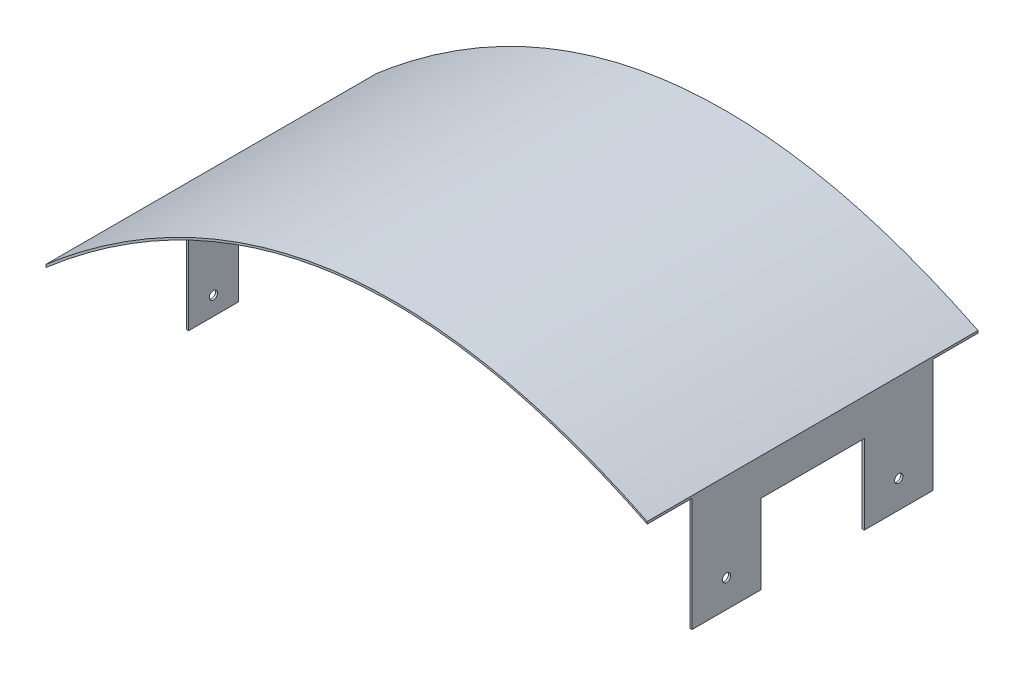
ISO-10303-21;
HEADER;
FILE_DESCRIPTION(('STEP AP214'),'2;1');
FILE_NAME('part.step','',(''),(''),'','','');
FILE_SCHEMA(('AUTOMOTIVE_DESIGN { 1 0 10303 214 1 1 1 1 }'));
ENDSEC;
DATA;
#1=APPLICATION_CONTEXT('core data for automotive mechanical design processes');
#2=APPLICATION_PROTOCOL_DEFINITION('international standard','automotive_design',2000,#1);
#3=PRODUCT_CONTEXT('',#1,'mechanical');
#4=PRODUCT('Part','Part','',(#3));
#5=PRODUCT_RELATED_PRODUCT_CATEGORY('part','',(#4));
#6=PRODUCT_DEFINITION_FORMATION('','',#4);
#7=PRODUCT_DEFINITION_CONTEXT('part definition',#1,'design');
#8=PRODUCT_DEFINITION('design','',#6,#7);
#9=PRODUCT_DEFINITION_SHAPE('','',#8);
#10=(LENGTH_UNIT() NAMED_UNIT(*) SI_UNIT(.MILLI.,.METRE.));
#11=(NAMED_UNIT(*) PLANE_ANGLE_UNIT() SI_UNIT($,.RADIAN.));
#12=(NAMED_UNIT(*) SI_UNIT($,.STERADIAN.) SOLID_ANGLE_UNIT());
#13=UNCERTAINTY_MEASURE_WITH_UNIT(LENGTH_MEASURE(1.E-05),#10,'distance_accuracy_value','');
#14=(GEOMETRIC_REPRESENTATION_CONTEXT(3) GLOBAL_UNCERTAINTY_ASSIGNED_CONTEXT((#13)) GLOBAL_UNIT_ASSIGNED_CONTEXT((#10,
#11,#12)) REPRESENTATION_CONTEXT('',''));
#15=CARTESIAN_POINT('',(0.,0.,0.));
#16=DIRECTION('',(0.,0.,1.));
#17=DIRECTION('',(1.,0.,0.));
#18=AXIS2_PLACEMENT_3D('',#15,#16,#17);
#19=CARTESIAN_POINT('',(-45.2500009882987,46.2333333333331,-114.233194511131));
#20=CARTESIAN_POINT('',(-5.08384592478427,80.8869347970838,-114.233194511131));
#21=CARTESIAN_POINT('',(41.9999999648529,57.599997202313,-114.233194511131));
#22=B_SPLINE_CURVE_WITH_KNOTS('',2,(#19,#20,#21),.UNSPECIFIED.,.F.,.F.,(3,3),(0.,1.),.UNSPECIFIED.);
#23=DIRECTION('',(0.,0.,1.));
#24=VECTOR('',#23,1.);
#25=SURFACE_OF_LINEAR_EXTRUSION('',#22,#24);
#26=CARTESIAN_POINT('',(41.6999999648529,57.747818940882,-17.5000084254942));
#27=CARTESIAN_POINT('',(41.7500365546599,57.723256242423,-17.5000084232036));
#28=CARTESIAN_POINT('',(41.8000548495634,57.6986564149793,-17.5000084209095));
#29=CARTESIAN_POINT('',(41.9000548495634,57.649382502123,-17.5000084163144));
#30=CARTESIAN_POINT('',(41.9500365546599,57.6247084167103,-17.5000084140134));
#31=CARTESIAN_POINT('',(41.9999999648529,57.599997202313,-17.5000084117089));
#32=B_SPLINE_CURVE_WITH_KNOTS('',3,(#26,#27,#28,#29,#30,#31),.UNSPECIFIED.,.F.,.F.,(4,2,4),(0.,
0.167220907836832,0.334441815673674),.UNSPECIFIED.);
#33=CARTESIAN_POINT('',(41.6999999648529,57.747818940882,-17.5000089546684));
#34=VERTEX_POINT('',#33);
#35=CARTESIAN_POINT('',(41.9999999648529,57.599997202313,-17.5000084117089));
#36=VERTEX_POINT('',#35);
#37=EDGE_CURVE('E888',#34,#36,#32,.T.);
#38=ORIENTED_EDGE('',*,*,#37,.F.);
#39=DIRECTION('',(0.,0.,1.));
#40=VECTOR('',#39,1.);
#41=CARTESIAN_POINT('',(41.6999999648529,57.747818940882,-4.31154512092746E-06));
#42=LINE('',#41,#40);
#43=CARTESIAN_POINT('',(41.6999999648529,57.747818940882,17.49999765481));
#44=VERTEX_POINT('',#43);
#45=EDGE_CURVE('E892',#44,#34,#42,.F.);
#46=ORIENTED_EDGE('',*,*,#45,.F.);
#47=CARTESIAN_POINT('',(41.9999999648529,57.5999988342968,17.499997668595));
#48=CARTESIAN_POINT('',(41.9500363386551,57.6247093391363,17.4999976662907));
#49=CARTESIAN_POINT('',(41.9000545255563,57.6493829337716,17.4999976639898));
#50=CARTESIAN_POINT('',(41.8000545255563,57.6986563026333,17.4999976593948));
#51=CARTESIAN_POINT('',(41.7500363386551,57.7232560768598,17.4999976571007));
#52=CARTESIAN_POINT('',(41.6999999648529,57.747818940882,17.49999765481));
#53=B_SPLINE_CURVE_WITH_KNOTS('',3,(#47,#48,#49,#50,#51,#52),.UNSPECIFIED.,.F.,.F.,(4,2,4),(0.,
0.167220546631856,0.334441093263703),.UNSPECIFIED.);
#54=CARTESIAN_POINT('',(41.9999999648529,57.6000004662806,17.499997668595));
#55=VERTEX_POINT('',#54);
#56=EDGE_CURVE('E1101',#55,#44,#53,.T.);
#57=ORIENTED_EDGE('',*,*,#56,.F.);
#58=DIRECTION('',(0.,0.,1.));
#59=VECTOR('',#58,1.);
#60=CARTESIAN_POINT('',(41.9999999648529,57.599997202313,-114.233194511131));
#61=LINE('',#60,#59);
#62=CARTESIAN_POINT('',(41.9999999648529,57.599997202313,23.9999942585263));
#63=VERTEX_POINT('',#62);
#64=EDGE_CURVE('E1218',#55,#63,#61,.T.);
#65=ORIENTED_EDGE('',*,*,#64,.T.);
#66=CARTESIAN_POINT('',(-45.2500009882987,46.2333333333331,23.9999942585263));
#67=CARTESIAN_POINT('',(-5.08384592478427,80.8869347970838,23.9999942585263));
#68=CARTESIAN_POINT('',(41.9999999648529,57.599997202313,23.9999942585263));
#69=B_SPLINE_CURVE_WITH_KNOTS('',2,(#66,#67,#68),.UNSPECIFIED.,.F.,.F.,(3,3),(0.,1.),.UNSPECIFIED.);
#70=CARTESIAN_POINT('',(-45.2500009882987,46.2333333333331,23.9999942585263));
#71=VERTEX_POINT('',#70);
#72=EDGE_CURVE('E1193',#71,#63,#69,.T.);
#73=ORIENTED_EDGE('',*,*,#72,.F.);
#74=DIRECTION('',(0.,0.,1.));
#75=VECTOR('',#74,1.);
#76=CARTESIAN_POINT('',(-45.2500009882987,46.2333333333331,-114.233194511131));
#77=LINE('',#76,#75);
#78=CARTESIAN_POINT('',(-45.2500009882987,46.2333340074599,3.6143761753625));
#79=VERTEX_POINT('',#78);
#80=EDGE_CURVE('E1223',#79,#71,#77,.T.);
#81=ORIENTED_EDGE('',*,*,#80,.F.);
#82=CARTESIAN_POINT('',(-44.9500009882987,46.4912694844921,3.61437615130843));
#83=CARTESIAN_POINT('',(-45.0000743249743,46.4483654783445,3.61437615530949));
#84=CARTESIAN_POINT('',(-45.0501109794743,46.4054188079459,3.61437615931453));
#85=CARTESIAN_POINT('',(-45.1501109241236,46.3194401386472,3.61437616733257));
#86=CARTESIAN_POINT('',(-45.2000742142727,46.2764081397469,3.61437617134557));
#87=CARTESIAN_POINT('',(-45.2500008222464,46.2333334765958,3.61437617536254));
#88=B_SPLINE_CURVE_WITH_KNOTS('',3,(#82,#83,#84,#85,#86,#87),.UNSPECIFIED.,.F.,.F.,(4,2,4),(0.,
0.197819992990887,0.395639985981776),.UNSPECIFIED.);
#89=CARTESIAN_POINT('',(-44.9500009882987,46.4912694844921,3.61437510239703));
#90=VERTEX_POINT('',#89);
#91=EDGE_CURVE('E1145',#90,#79,#88,.T.);
#92=ORIENTED_EDGE('',*,*,#91,.F.);
#93=DIRECTION('',(0.,0.,1.));
#94=VECTOR('',#93,1.);
#95=CARTESIAN_POINT('',(-44.9500009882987,46.4912694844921,-4.31154512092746E-06));
#96=LINE('',#95,#94);
#97=CARTESIAN_POINT('',(-44.9500009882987,46.4912694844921,-3.61438587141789));
#98=VERTEX_POINT('',#97);
#99=EDGE_CURVE('E1141',#98,#90,#96,.T.);
#100=ORIENTED_EDGE('',*,*,#99,.F.);
#101=CARTESIAN_POINT('',(-45.2500009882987,46.2333333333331,-3.61438479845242));
#102=CARTESIAN_POINT('',(-45.2000743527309,46.2764080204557,-3.61438480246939));
#103=CARTESIAN_POINT('',(-45.150111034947,46.3194400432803,-3.61438480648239));
#104=CARTESIAN_POINT('',(-45.050111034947,46.4054187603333,-3.61438481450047));
#105=CARTESIAN_POINT('',(-45.0000743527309,46.4483654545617,-3.61438481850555));
#106=CARTESIAN_POINT('',(-44.9500009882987,46.4912694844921,-3.61438482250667));
#107=B_SPLINE_CURVE_WITH_KNOTS('',3,(#101,#102,#103,#104,#105,#106),.UNSPECIFIED.,.F.,.F.,(4,2,
4),(0.,0.197820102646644,0.395640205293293),.UNSPECIFIED.);
#108=CARTESIAN_POINT('',(-45.2500009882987,46.2333333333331,-3.61438479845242));
#109=VERTEX_POINT('',#108);
#110=EDGE_CURVE('E1153',#109,#98,#107,.T.);
#111=ORIENTED_EDGE('',*,*,#110,.F.);
#112=CARTESIAN_POINT('',(-45.2500009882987,46.2333333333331,-24.0000028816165));
#113=VERTEX_POINT('',#112);
#114=EDGE_CURVE('E1219',#113,#109,#77,.T.);
#115=ORIENTED_EDGE('',*,*,#114,.F.);
#116=CARTESIAN_POINT('',(-45.2500009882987,46.2333333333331,-24.0000028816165));
#117=CARTESIAN_POINT('',(-5.08384592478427,80.8869347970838,-24.0000028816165));
#118=CARTESIAN_POINT('',(41.9999999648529,57.599997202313,-24.0000028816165));
#119=B_SPLINE_CURVE_WITH_KNOTS('',2,(#116,#117,#118),.UNSPECIFIED.,.F.,.F.,(3,3),(0.,1.),.UNSPECIFIED.);
#120=CARTESIAN_POINT('',(41.9999999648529,57.599997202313,-24.0000028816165));
#121=VERTEX_POINT('',#120);
#122=EDGE_CURVE('E881',#121,#113,#119,.F.);
#123=ORIENTED_EDGE('',*,*,#122,.F.);
#124=EDGE_CURVE('E1227',#121,#36,#61,.T.);
#125=ORIENTED_EDGE('',*,*,#124,.T.);
#126=EDGE_LOOP('',(#38,#46,#57,#65,#73,#81,#92,#100,#111,#115,#123,#125));
#127=FACE_BOUND('',#126,.T.);
#128=ADVANCED_FACE('F873',(#127),#25,.T.);
#129=CARTESIAN_POINT('',(-45.2500009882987,46.6291754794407,-114.233194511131));
#130=DIRECTION('',(-1.,0.,0.));
#131=DIRECTION('',(0.,-1.,0.));
#132=AXIS2_PLACEMENT_3D('',#129,#130,#131);
#133=PLANE('',#132);
#134=DIRECTION('',(0.,1.,0.));
#135=VECTOR('',#134,1.);
#136=CARTESIAN_POINT('',(-45.2500009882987,46.6291754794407,-24.0000028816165));
#137=LINE('',#136,#135);
#138=CARTESIAN_POINT('',(-45.2500009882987,46.6291754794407,-24.0000028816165));
#139=VERTEX_POINT('',#138);
#140=EDGE_CURVE('E1262',#113,#139,#137,.T.);
#141=ORIENTED_EDGE('',*,*,#140,.F.);
#142=ORIENTED_EDGE('',*,*,#114,.T.);
#143=DIRECTION('',(0.,-1.,0.));
#144=VECTOR('',#143,1.);
#145=CARTESIAN_POINT('',(-45.2500009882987,33.7333333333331,-3.61438479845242));
#146=LINE('',#145,#144);
#147=CARTESIAN_POINT('',(-45.2500009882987,28.2333333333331,-3.61438479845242));
#148=VERTEX_POINT('',#147);
#149=EDGE_CURVE('E1275',#109,#148,#146,.T.);
#150=ORIENTED_EDGE('',*,*,#149,.T.);
#151=DIRECTION('',(0.,0.,1.));
#152=VECTOR('',#151,1.);
#153=CARTESIAN_POINT('',(-45.2500009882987,28.2333333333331,-3.61438479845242));
#154=LINE('',#153,#152);
#155=CARTESIAN_POINT('',(-45.2500009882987,28.2333333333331,-2.63293334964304E-06));
#156=VERTEX_POINT('',#155);
#157=EDGE_CURVE('E1294',#148,#156,#154,.T.);
#158=ORIENTED_EDGE('',*,*,#157,.T.);
#159=DIRECTION('',(0.,1.86512397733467E-07,0.999999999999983));
#160=VECTOR('',#159,1.);
#161=CARTESIAN_POINT('',(-45.2500009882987,28.2333340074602,3.61437953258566));
#162=LINE('',#161,#160);
#163=CARTESIAN_POINT('',(-45.2500009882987,28.2333340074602,3.61437953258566));
#164=VERTEX_POINT('',#163);
#165=EDGE_CURVE('E1285',#156,#164,#162,.T.);
#166=ORIENTED_EDGE('',*,*,#165,.T.);
#167=DIRECTION('',(0.,0.999999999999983,-1.86512397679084E-07));
#168=VECTOR('',#167,1.);
#169=CARTESIAN_POINT('',(-45.2500009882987,33.7333340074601,3.61437850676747));
#170=LINE('',#169,#168);
#171=EDGE_CURVE('E1244',#164,#79,#170,.T.);
#172=ORIENTED_EDGE('',*,*,#171,.T.);
#173=ORIENTED_EDGE('',*,*,#80,.T.);
#174=DIRECTION('',(0.,-1.,0.));
#175=VECTOR('',#174,1.);
#176=CARTESIAN_POINT('',(-45.2500009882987,46.6291754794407,23.9999942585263));
#177=LINE('',#176,#175);
#178=CARTESIAN_POINT('',(-45.2500009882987,46.6291754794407,23.9999942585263));
#179=VERTEX_POINT('',#178);
#180=EDGE_CURVE('E1212',#179,#71,#177,.T.);
#181=ORIENTED_EDGE('',*,*,#180,.F.);
#182=DIRECTION('',(0.,0.,1.));
#183=VECTOR('',#182,1.);
#184=CARTESIAN_POINT('',(-45.2500009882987,46.6291754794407,-114.233194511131));
#185=LINE('',#184,#183);
#186=EDGE_CURVE('E1224',#139,#179,#185,.T.);
#187=ORIENTED_EDGE('',*,*,#186,.F.);
#188=EDGE_LOOP('',(#141,#142,#150,#158,#166,#172,#173,#181,#187));
#189=FACE_BOUND('',#188,.T.);
#190=CARTESIAN_POINT('',(-45.2500009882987,30.8999999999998,-2.8816165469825E-06));
#191=DIRECTION('',(-1.,0.,0.));
#192=DIRECTION('',(0.,0.,1.));
#193=AXIS2_PLACEMENT_3D('',#190,#191,#192);
#194=CIRCLE('',#193,0.600000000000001);
#195=CARTESIAN_POINT('',(-45.2500009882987,30.8999999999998,0.599997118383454));
#196=VERTEX_POINT('',#195);
#197=EDGE_CURVE('E1108',#196,#196,#194,.T.);
#198=ORIENTED_EDGE('',*,*,#197,.F.);
#199=EDGE_LOOP('',(#198));
#200=FACE_BOUND('',#199,.T.);
#201=ADVANCED_FACE('F1177',(#189,#200),#133,.T.);
#202=CARTESIAN_POINT('',(42.1329879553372,57.8688856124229,-114.233194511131));
#203=CARTESIAN_POINT('',(24.4285494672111,66.6285236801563,-114.233194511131));
#204=CARTESIAN_POINT('',(-3.50191950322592,67.6088890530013,-114.233194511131));
#205=CARTESIAN_POINT('',(-30.3449209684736,59.4929238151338,-114.233194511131));
#206=CARTESIAN_POINT('',(-45.4459472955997,46.4604500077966,-114.233194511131));
#207=B_SPLINE_CURVE_WITH_KNOTS('',2,(#202,#203,#204,#205,#206),.UNSPECIFIED.,.F.,.F.,(3,1,1,3),
(0.,0.375,0.625,1.),.UNSPECIFIED.);
#208=DIRECTION('',(0.,0.,1.));
#209=VECTOR('',#208,1.);
#210=SURFACE_OF_LINEAR_EXTRUSION('',#207,#209);
#211=CARTESIAN_POINT('',(42.1329879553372,57.8688856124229,-24.0000028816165));
#212=CARTESIAN_POINT('',(24.4285494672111,66.6285236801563,-24.0000028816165));
#213=CARTESIAN_POINT('',(-3.50191950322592,67.6088890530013,-24.0000028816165));
#214=CARTESIAN_POINT('',(-30.3449209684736,59.4929238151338,-24.0000028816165));
#215=CARTESIAN_POINT('',(-45.4459472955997,46.4604500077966,-24.0000028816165));
#216=B_SPLINE_CURVE_WITH_KNOTS('',2,(#211,#212,#213,#214,#215),.UNSPECIFIED.,.F.,.F.,(3,1,1,3),
(0.,0.375,0.625,1.),.UNSPECIFIED.);
#217=CARTESIAN_POINT('',(41.9999999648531,57.9345754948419,-24.0000028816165));
#218=VERTEX_POINT('',#217);
#219=EDGE_CURVE('E1222',#139,#218,#216,.F.);
#220=ORIENTED_EDGE('',*,*,#219,.F.);
#221=ORIENTED_EDGE('',*,*,#186,.T.);
#222=CARTESIAN_POINT('',(42.1329879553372,57.8688856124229,23.9999942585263));
#223=CARTESIAN_POINT('',(24.4285494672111,66.6285236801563,23.9999942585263));
#224=CARTESIAN_POINT('',(-3.50191950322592,67.6088890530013,23.9999942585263));
#225=CARTESIAN_POINT('',(-30.3449209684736,59.4929238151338,23.9999942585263));
#226=CARTESIAN_POINT('',(-45.4459472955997,46.4604500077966,23.9999942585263));
#227=B_SPLINE_CURVE_WITH_KNOTS('',2,(#222,#223,#224,#225,#226),.UNSPECIFIED.,.F.,.F.,(3,1,1,3),
(0.,0.375,0.625,1.),.UNSPECIFIED.);
#228=CARTESIAN_POINT('',(41.9999999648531,57.9345754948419,23.9999942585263));
#229=VERTEX_POINT('',#228);
#230=EDGE_CURVE('E1207',#229,#179,#227,.T.);
#231=ORIENTED_EDGE('',*,*,#230,.F.);
#232=DIRECTION('',(0.,0.,1.));
#233=VECTOR('',#232,1.);
#234=CARTESIAN_POINT('',(41.9999999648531,57.9345754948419,-114.233194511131));
#235=LINE('',#234,#233);
#236=EDGE_CURVE('E1226',#218,#229,#235,.T.);
#237=ORIENTED_EDGE('',*,*,#236,.F.);
#238=EDGE_LOOP('',(#220,#221,#231,#237));
#239=FACE_BOUND('',#238,.T.);
#240=ADVANCED_FACE('F1180',(#239),#210,.T.);
#241=CARTESIAN_POINT('',(41.9999999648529,57.599997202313,-114.233194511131));
#242=DIRECTION('',(1.,-4.14784465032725E-13,0.));
#243=DIRECTION('',(4.14784465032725E-13,1.,0.));
#244=AXIS2_PLACEMENT_3D('',#241,#242,#243);
#245=PLANE('',#244);
#246=DIRECTION('',(-4.14784465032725E-13,-1.,0.));
#247=VECTOR('',#246,1.);
#248=CARTESIAN_POINT('',(41.9999999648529,57.599997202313,-24.0000028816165));
#249=LINE('',#248,#247);
#250=EDGE_CURVE('E294',#218,#121,#249,.T.);
#251=ORIENTED_EDGE('',*,*,#250,.F.);
#252=ORIENTED_EDGE('',*,*,#236,.T.);
#253=DIRECTION('',(4.14784465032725E-13,1.,0.));
#254=VECTOR('',#253,1.);
#255=CARTESIAN_POINT('',(41.9999999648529,57.599997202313,23.9999942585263));
#256=LINE('',#255,#254);
#257=EDGE_CURVE('E1201',#63,#229,#256,.T.);
#258=ORIENTED_EDGE('',*,*,#257,.F.);
#259=ORIENTED_EDGE('',*,*,#64,.F.);
#260=DIRECTION('',(0.,-0.999999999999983,1.86512397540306E-07));
#261=VECTOR('',#260,1.);
#262=CARTESIAN_POINT('',(41.9999999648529,45.1000004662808,17.5));
#263=LINE('',#262,#261);
#264=CARTESIAN_POINT('',(41.9999999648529,41.1000004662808,17.5000007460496));
#265=VERTEX_POINT('',#264);
#266=EDGE_CURVE('E1058',#55,#265,#263,.T.);
#267=ORIENTED_EDGE('',*,*,#266,.T.);
#268=DIRECTION('',(0.,-1.86512397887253E-07,-0.999999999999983));
#269=VECTOR('',#268,1.);
#270=CARTESIAN_POINT('',(41.9999999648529,41.1000004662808,17.5000007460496));
#271=LINE('',#270,#269);
#272=CARTESIAN_POINT('',(41.9999999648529,41.0999986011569,7.50000074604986));
#273=VERTEX_POINT('',#272);
#274=EDGE_CURVE('E1061',#265,#273,#271,.T.);
#275=ORIENTED_EDGE('',*,*,#274,.T.);
#276=DIRECTION('',(0.,0.999999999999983,-1.86512398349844E-07));
#277=VECTOR('',#276,1.);
#278=CARTESIAN_POINT('',(41.9999999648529,45.0999999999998,7.5));
#279=LINE('',#278,#277);
#280=CARTESIAN_POINT('',(41.9999999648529,52.5999999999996,7.49999860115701));
#281=VERTEX_POINT('',#280);
#282=EDGE_CURVE('E1064',#273,#281,#279,.T.);
#283=ORIENTED_EDGE('',*,*,#282,.T.);
#284=DIRECTION('',(0.,-1.86512398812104E-07,-0.999999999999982));
#285=VECTOR('',#284,1.);
#286=CARTESIAN_POINT('',(41.9999999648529,52.5999999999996,7.49999860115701));
#287=LINE('',#286,#285);
#288=CARTESIAN_POINT('',(41.9999999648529,52.599998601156,-4.90527594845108E-06));
#289=VERTEX_POINT('',#288);
#290=EDGE_CURVE('E1067',#281,#289,#287,.T.);
#291=ORIENTED_EDGE('',*,*,#290,.T.);
#292=DIRECTION('',(0.,0.,-1.));
#293=VECTOR('',#292,1.);
#294=CARTESIAN_POINT('',(41.9999999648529,52.599998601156,-7.50000841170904));
#295=LINE('',#294,#293);
#296=CARTESIAN_POINT('',(41.9999999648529,52.599998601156,-7.50000841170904));
#297=VERTEX_POINT('',#296);
#298=EDGE_CURVE('E1020',#289,#297,#295,.T.);
#299=ORIENTED_EDGE('',*,*,#298,.T.);
#300=DIRECTION('',(0.,-1.,0.));
#301=VECTOR('',#300,1.);
#302=CARTESIAN_POINT('',(41.9999999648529,41.099997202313,-7.50000841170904));
#303=LINE('',#302,#301);
#304=CARTESIAN_POINT('',(41.9999999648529,41.099997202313,-7.50000841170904));
#305=VERTEX_POINT('',#304);
#306=EDGE_CURVE('E1052',#297,#305,#303,.T.);
#307=ORIENTED_EDGE('',*,*,#306,.T.);
#308=DIRECTION('',(0.,0.,-1.));
#309=VECTOR('',#308,1.);
#310=CARTESIAN_POINT('',(41.9999999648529,41.099997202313,-17.5000084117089));
#311=LINE('',#310,#309);
#312=CARTESIAN_POINT('',(41.9999999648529,41.099997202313,-17.5000084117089));
#313=VERTEX_POINT('',#312);
#314=EDGE_CURVE('E1027',#305,#313,#311,.T.);
#315=ORIENTED_EDGE('',*,*,#314,.T.);
#316=DIRECTION('',(0.,1.,0.));
#317=VECTOR('',#316,1.);
#318=CARTESIAN_POINT('',(41.9999999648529,45.099997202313,-17.5000084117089));
#319=LINE('',#318,#317);
#320=EDGE_CURVE('E1056',#313,#36,#319,.T.);
#321=ORIENTED_EDGE('',*,*,#320,.T.);
#322=ORIENTED_EDGE('',*,*,#124,.F.);
#323=EDGE_LOOP('',(#251,#252,#258,#259,#267,#275,#283,#291,#299,#307,#315,#321,#322));
#324=FACE_BOUND('',#323,.T.);
#325=CARTESIAN_POINT('',(41.9999999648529,45.0999999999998,-12.5));
#326=DIRECTION('',(1.,0.,0.));
#327=DIRECTION('',(0.,0.,-1.));
#328=AXIS2_PLACEMENT_3D('',#325,#326,#327);
#329=CIRCLE('',#328,0.600000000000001);
#330=CARTESIAN_POINT('',(41.9999999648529,45.0999999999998,-13.1));
#331=VERTEX_POINT('',#330);
#332=EDGE_CURVE('E1514',#331,#331,#329,.T.);
#333=ORIENTED_EDGE('',*,*,#332,.F.);
#334=EDGE_LOOP('',(#333));
#335=FACE_BOUND('',#334,.T.);
#336=CARTESIAN_POINT('',(41.9999999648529,45.0999999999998,12.5));
#337=DIRECTION('',(1.,0.,0.));
#338=DIRECTION('',(0.,0.,-1.));
#339=AXIS2_PLACEMENT_3D('',#336,#337,#338);
#340=CIRCLE('',#339,0.600000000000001);
#341=CARTESIAN_POINT('',(41.9999999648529,45.0999999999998,11.9));
#342=VERTEX_POINT('',#341);
#343=EDGE_CURVE('E1516',#342,#342,#340,.T.);
#344=ORIENTED_EDGE('',*,*,#343,.F.);
#345=EDGE_LOOP('',(#344));
#346=FACE_BOUND('',#345,.T.);
#347=ADVANCED_FACE('F1175',(#324,#335,#346),#245,.T.);
#348=CARTESIAN_POINT('',(-3.35442321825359,66.4018000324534,23.9999942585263));
#349=DIRECTION('',(0.,0.,1.));
#350=DIRECTION('',(1.,0.,0.));
#351=AXIS2_PLACEMENT_3D('',#348,#349,#350);
#352=PLANE('',#351);
#353=ORIENTED_EDGE('',*,*,#72,.T.);
#354=ORIENTED_EDGE('',*,*,#257,.T.);
#355=ORIENTED_EDGE('',*,*,#230,.T.);
#356=ORIENTED_EDGE('',*,*,#180,.T.);
#357=EDGE_LOOP('',(#353,#354,#355,#356));
#358=FACE_BOUND('',#357,.T.);
#359=ADVANCED_FACE('F1171',(#358),#352,.T.);
#360=CARTESIAN_POINT('',(0.,0.,-24.0000028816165));
#361=DIRECTION('',(0.,0.,1.));
#362=DIRECTION('',(1.,0.,0.));
#363=AXIS2_PLACEMENT_3D('',#360,#361,#362);
#364=PLANE('',#363);
#365=ORIENTED_EDGE('',*,*,#122,.T.);
#366=ORIENTED_EDGE('',*,*,#140,.T.);
#367=ORIENTED_EDGE('',*,*,#219,.T.);
#368=ORIENTED_EDGE('',*,*,#250,.T.);
#369=EDGE_LOOP('',(#365,#366,#367,#368));
#370=FACE_BOUND('',#369,.T.);
#371=ADVANCED_FACE('F1168',(#370),#364,.F.);
#372=CARTESIAN_POINT('',(-44.9500009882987,69.2444685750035,3.61437402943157));
#373=DIRECTION('',(-1.,0.,0.));
#374=DIRECTION('',(0.,0.,1.));
#375=AXIS2_PLACEMENT_3D('',#372,#373,#374);
#376=PLANE('',#375);
#377=DIRECTION('',(0.,-0.999999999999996,9.32561985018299E-08));
#378=VECTOR('',#377,1.);
#379=CARTESIAN_POINT('',(-44.9500009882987,69.2444679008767,-3.61438694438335));
#380=LINE('',#379,#378);
#381=CARTESIAN_POINT('',(-44.9500009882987,46.2333333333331,-3.61438479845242));
#382=VERTEX_POINT('',#381);
#383=EDGE_CURVE('E1254',#98,#382,#380,.T.);
#384=ORIENTED_EDGE('',*,*,#383,.F.);
#385=ORIENTED_EDGE('',*,*,#99,.T.);
#386=DIRECTION('',(0.,-0.999999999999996,9.32561985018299E-08));
#387=VECTOR('',#386,1.);
#388=CARTESIAN_POINT('',(-44.9500009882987,69.2444685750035,3.61437402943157));
#389=LINE('',#388,#387);
#390=CARTESIAN_POINT('',(-44.9500009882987,46.2333340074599,3.6143761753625));
#391=VERTEX_POINT('',#390);
#392=EDGE_CURVE('E1146',#90,#391,#389,.T.);
#393=ORIENTED_EDGE('',*,*,#392,.T.);
#394=DIRECTION('',(0.,0.999999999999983,-1.86512397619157E-07));
#395=VECTOR('',#394,1.);
#396=CARTESIAN_POINT('',(-44.9500009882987,33.7333340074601,3.61437850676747));
#397=LINE('',#396,#395);
#398=CARTESIAN_POINT('',(-44.9500009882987,28.2333340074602,3.61437953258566));
#399=VERTEX_POINT('',#398);
#400=EDGE_CURVE('E1252',#399,#391,#397,.T.);
#401=ORIENTED_EDGE('',*,*,#400,.F.);
#402=DIRECTION('',(0.,1.86512397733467E-07,0.999999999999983));
#403=VECTOR('',#402,1.);
#404=CARTESIAN_POINT('',(-44.9500009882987,28.2333340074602,3.61437953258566));
#405=LINE('',#404,#403);
#406=CARTESIAN_POINT('',(-44.9500009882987,28.2333333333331,-2.63293334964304E-06));
#407=VERTEX_POINT('',#406);
#408=EDGE_CURVE('E1283',#407,#399,#405,.T.);
#409=ORIENTED_EDGE('',*,*,#408,.F.);
#410=DIRECTION('',(0.,0.,1.));
#411=VECTOR('',#410,1.);
#412=CARTESIAN_POINT('',(-44.9500009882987,28.2333333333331,-3.61438479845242));
#413=LINE('',#412,#411);
#414=CARTESIAN_POINT('',(-44.9500009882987,28.2333333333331,-3.61438479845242));
#415=VERTEX_POINT('',#414);
#416=EDGE_CURVE('E1280',#415,#407,#413,.T.);
#417=ORIENTED_EDGE('',*,*,#416,.F.);
#418=DIRECTION('',(0.,-1.,0.));
#419=VECTOR('',#418,1.);
#420=CARTESIAN_POINT('',(-44.9500009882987,33.7333333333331,-3.61438479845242));
#421=LINE('',#420,#419);
#422=EDGE_CURVE('E1278',#382,#415,#421,.T.);
#423=ORIENTED_EDGE('',*,*,#422,.F.);
#424=EDGE_LOOP('',(#384,#385,#393,#401,#409,#417,#423));
#425=FACE_BOUND('',#424,.T.);
#426=CARTESIAN_POINT('',(-44.9500009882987,30.8999999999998,-2.8816165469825E-06));
#427=DIRECTION('',(-1.,0.,0.));
#428=DIRECTION('',(0.,0.,1.));
#429=AXIS2_PLACEMENT_3D('',#426,#427,#428);
#430=CIRCLE('',#429,0.600000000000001);
#431=CARTESIAN_POINT('',(-44.9500009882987,30.8999999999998,0.599997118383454));
#432=VERTEX_POINT('',#431);
#433=EDGE_CURVE('E1295',#432,#432,#430,.T.);
#434=ORIENTED_EDGE('',*,*,#433,.T.);
#435=EDGE_LOOP('',(#434));
#436=FACE_BOUND('',#435,.T.);
#437=ADVANCED_FACE('F1130',(#425,#436),#376,.F.);
#438=CARTESIAN_POINT('',(-45.2500009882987,69.2444685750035,3.61437402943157));
#439=DIRECTION('',(0.,-9.32561985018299E-08,-0.999999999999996));
#440=DIRECTION('',(0.,0.999999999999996,-9.32561985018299E-08));
#441=AXIS2_PLACEMENT_3D('',#438,#439,#440);
#442=PLANE('',#441);
#443=ORIENTED_EDGE('',*,*,#392,.F.);
#444=ORIENTED_EDGE('',*,*,#91,.T.);
#445=ORIENTED_EDGE('',*,*,#171,.F.);
#446=DIRECTION('',(-1.,0.,0.));
#447=VECTOR('',#446,1.);
#448=CARTESIAN_POINT('',(-44.9500009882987,28.2333340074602,3.61437953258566));
#449=LINE('',#448,#447);
#450=EDGE_CURVE('E1257',#399,#164,#449,.T.);
#451=ORIENTED_EDGE('',*,*,#450,.F.);
#452=ORIENTED_EDGE('',*,*,#400,.T.);
#453=EDGE_LOOP('',(#443,#444,#445,#451,#452));
#454=FACE_BOUND('',#453,.T.);
#455=ADVANCED_FACE('F1160',(#454),#442,.F.);
#456=CARTESIAN_POINT('',(-44.9500009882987,69.2444679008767,-3.61438694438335));
#457=DIRECTION('',(0.,9.32561985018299E-08,0.999999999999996));
#458=DIRECTION('',(0.,-0.999999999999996,9.32561985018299E-08));
#459=AXIS2_PLACEMENT_3D('',#456,#457,#458);
#460=PLANE('',#459);
#461=ORIENTED_EDGE('',*,*,#383,.T.);
#462=ORIENTED_EDGE('',*,*,#422,.T.);
#463=DIRECTION('',(-1.,0.,0.));
#464=VECTOR('',#463,1.);
#465=CARTESIAN_POINT('',(-44.9500009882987,28.2333333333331,-3.61438479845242));
#466=LINE('',#465,#464);
#467=EDGE_CURVE('E1139',#415,#148,#466,.T.);
#468=ORIENTED_EDGE('',*,*,#467,.T.);
#469=ORIENTED_EDGE('',*,*,#149,.F.);
#470=ORIENTED_EDGE('',*,*,#110,.T.);
#471=EDGE_LOOP('',(#461,#462,#468,#469,#470));
#472=FACE_BOUND('',#471,.T.);
#473=ADVANCED_FACE('F1125',(#472),#460,.F.);
#474=CARTESIAN_POINT('',(-44.9500009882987,28.2333340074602,3.61437953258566));
#475=DIRECTION('',(0.,-0.999999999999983,1.86512397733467E-07));
#476=DIRECTION('',(0.,-1.86512397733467E-07,-0.999999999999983));
#477=AXIS2_PLACEMENT_3D('',#474,#475,#476);
#478=PLANE('',#477);
#479=ORIENTED_EDGE('',*,*,#165,.F.);
#480=ORIENTED_EDGE('',*,*,#157,.F.);
#481=ORIENTED_EDGE('',*,*,#467,.F.);
#482=ORIENTED_EDGE('',*,*,#416,.T.);
#483=ORIENTED_EDGE('',*,*,#408,.T.);
#484=ORIENTED_EDGE('',*,*,#450,.T.);
#485=EDGE_LOOP('',(#479,#480,#481,#482,#483,#484));
#486=FACE_BOUND('',#485,.T.);
#487=ADVANCED_FACE('F1121',(#486),#478,.T.);
#488=CARTESIAN_POINT('',(-44.9500009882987,30.8999999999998,-2.8816165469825E-06));
#489=DIRECTION('',(-1.,0.,0.));
#490=DIRECTION('',(0.,0.,1.));
#491=AXIS2_PLACEMENT_3D('',#488,#489,#490);
#492=CYLINDRICAL_SURFACE('',#491,0.600000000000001);
#493=ORIENTED_EDGE('',*,*,#433,.F.);
#494=EDGE_LOOP('',(#493));
#495=FACE_BOUND('',#494,.T.);
#496=ORIENTED_EDGE('',*,*,#197,.T.);
#497=EDGE_LOOP('',(#496));
#498=FACE_BOUND('',#497,.T.);
#499=ADVANCED_FACE('F1118',(#495,#498),#492,.F.);
#500=CARTESIAN_POINT('',(41.6999999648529,69.2444666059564,-17.5000094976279));
#501=DIRECTION('',(1.,0.,0.));
#502=DIRECTION('',(0.,0.,-1.));
#503=AXIS2_PLACEMENT_3D('',#500,#501,#502);
#504=PLANE('',#503);
#505=DIRECTION('',(0.,-0.999999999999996,9.32561992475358E-08));
#506=VECTOR('',#505,1.);
#507=CARTESIAN_POINT('',(41.6999999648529,69.2444698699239,17.4999965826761));
#508=LINE('',#507,#506);
#509=CARTESIAN_POINT('',(41.6999999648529,57.6000004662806,17.499997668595));
#510=VERTEX_POINT('',#509);
#511=EDGE_CURVE('E1072',#44,#510,#508,.T.);
#512=ORIENTED_EDGE('',*,*,#511,.F.);
#513=ORIENTED_EDGE('',*,*,#45,.T.);
#514=DIRECTION('',(0.,-0.999999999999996,9.32561992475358E-08));
#515=VECTOR('',#514,1.);
#516=CARTESIAN_POINT('',(41.6999999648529,69.2444666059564,-17.5000094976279));
#517=LINE('',#516,#515);
#518=CARTESIAN_POINT('',(41.6999999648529,57.599997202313,-17.5000084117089));
#519=VERTEX_POINT('',#518);
#520=EDGE_CURVE('E1302',#34,#519,#517,.T.);
#521=ORIENTED_EDGE('',*,*,#520,.T.);
#522=DIRECTION('',(0.,1.,0.));
#523=VECTOR('',#522,1.);
#524=CARTESIAN_POINT('',(41.6999999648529,45.099997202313,-17.5000084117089));
#525=LINE('',#524,#523);
#526=CARTESIAN_POINT('',(41.6999999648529,41.099997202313,-17.5000084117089));
#527=VERTEX_POINT('',#526);
#528=EDGE_CURVE('E1037',#527,#519,#525,.T.);
#529=ORIENTED_EDGE('',*,*,#528,.F.);
#530=DIRECTION('',(0.,0.,-1.));
#531=VECTOR('',#530,1.);
#532=CARTESIAN_POINT('',(41.6999999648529,41.099997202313,-17.5000084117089));
#533=LINE('',#532,#531);
#534=CARTESIAN_POINT('',(41.6999999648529,41.099997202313,-7.50000841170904));
#535=VERTEX_POINT('',#534);
#536=EDGE_CURVE('E1019',#535,#527,#533,.T.);
#537=ORIENTED_EDGE('',*,*,#536,.F.);
#538=DIRECTION('',(0.,-1.,0.));
#539=VECTOR('',#538,1.);
#540=CARTESIAN_POINT('',(41.6999999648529,45.099998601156,-7.50000841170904));
#541=LINE('',#540,#539);
#542=CARTESIAN_POINT('',(41.6999999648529,52.599998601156,-7.50000841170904));
#543=VERTEX_POINT('',#542);
#544=EDGE_CURVE('E1008',#543,#535,#541,.T.);
#545=ORIENTED_EDGE('',*,*,#544,.F.);
#546=DIRECTION('',(0.,0.,-1.));
#547=VECTOR('',#546,1.);
#548=CARTESIAN_POINT('',(41.6999999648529,52.599998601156,-7.50000841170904));
#549=LINE('',#548,#547);
#550=CARTESIAN_POINT('',(41.6999999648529,52.599998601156,-4.90527594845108E-06));
#551=VERTEX_POINT('',#550);
#552=EDGE_CURVE('E1030',#551,#543,#549,.T.);
#553=ORIENTED_EDGE('',*,*,#552,.F.);
#554=DIRECTION('',(0.,-1.86512398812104E-07,-0.999999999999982));
#555=VECTOR('',#554,1.);
#556=CARTESIAN_POINT('',(41.6999999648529,52.5999999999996,7.49999860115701));
#557=LINE('',#556,#555);
#558=CARTESIAN_POINT('',(41.6999999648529,52.5999999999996,7.49999860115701));
#559=VERTEX_POINT('',#558);
#560=EDGE_CURVE('E1049',#559,#551,#557,.T.);
#561=ORIENTED_EDGE('',*,*,#560,.F.);
#562=DIRECTION('',(0.,0.999999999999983,-1.86512398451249E-07));
#563=VECTOR('',#562,1.);
#564=CARTESIAN_POINT('',(41.6999999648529,41.0999986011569,7.50000074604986));
#565=LINE('',#564,#563);
#566=CARTESIAN_POINT('',(41.6999999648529,41.0999986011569,7.50000074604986));
#567=VERTEX_POINT('',#566);
#568=EDGE_CURVE('E1047',#567,#559,#565,.T.);
#569=ORIENTED_EDGE('',*,*,#568,.F.);
#570=DIRECTION('',(0.,-1.86512397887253E-07,-0.999999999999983));
#571=VECTOR('',#570,1.);
#572=CARTESIAN_POINT('',(41.6999999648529,41.1000004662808,17.5000007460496));
#573=LINE('',#572,#571);
#574=CARTESIAN_POINT('',(41.6999999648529,41.1000004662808,17.5000007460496));
#575=VERTEX_POINT('',#574);
#576=EDGE_CURVE('E1044',#575,#567,#573,.T.);
#577=ORIENTED_EDGE('',*,*,#576,.F.);
#578=DIRECTION('',(0.,-0.999999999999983,1.86512397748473E-07));
#579=VECTOR('',#578,1.);
#580=CARTESIAN_POINT('',(41.6999999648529,45.1000004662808,17.5));
#581=LINE('',#580,#579);
#582=EDGE_CURVE('E1039',#510,#575,#581,.T.);
#583=ORIENTED_EDGE('',*,*,#582,.F.);
#584=EDGE_LOOP('',(#512,#513,#521,#529,#537,#545,#553,#561,#569,#577,#583));
#585=FACE_BOUND('',#584,.T.);
#586=CARTESIAN_POINT('',(41.6999999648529,45.0999999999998,-12.5));
#587=DIRECTION('',(1.,0.,0.));
#588=DIRECTION('',(0.,0.,-1.));
#589=AXIS2_PLACEMENT_3D('',#586,#587,#588);
#590=CIRCLE('',#589,0.600000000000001);
#591=CARTESIAN_POINT('',(41.6999999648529,45.0999999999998,-13.1));
#592=VERTEX_POINT('',#591);
#593=EDGE_CURVE('E1511',#592,#592,#590,.T.);
#594=ORIENTED_EDGE('',*,*,#593,.T.);
#595=EDGE_LOOP('',(#594));
#596=FACE_BOUND('',#595,.T.);
#597=CARTESIAN_POINT('',(41.6999999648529,45.0999999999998,12.5));
#598=DIRECTION('',(1.,0.,0.));
#599=DIRECTION('',(0.,0.,-1.));
#600=AXIS2_PLACEMENT_3D('',#597,#598,#599);
#601=CIRCLE('',#600,0.600000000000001);
#602=CARTESIAN_POINT('',(41.6999999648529,45.0999999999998,11.9));
#603=VERTEX_POINT('',#602);
#604=EDGE_CURVE('E1054',#603,#603,#601,.T.);
#605=ORIENTED_EDGE('',*,*,#604,.T.);
#606=EDGE_LOOP('',(#605));
#607=FACE_BOUND('',#606,.T.);
#608=ADVANCED_FACE('F1034',(#585,#596,#607),#504,.F.);
#609=CARTESIAN_POINT('',(41.9999999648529,69.2444666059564,-17.5000094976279));
#610=DIRECTION('',(0.,9.32561992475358E-08,0.999999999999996));
#611=DIRECTION('',(0.,-0.999999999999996,9.32561992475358E-08));
#612=AXIS2_PLACEMENT_3D('',#609,#610,#611);
#613=PLANE('',#612);
#614=ORIENTED_EDGE('',*,*,#520,.F.);
#615=ORIENTED_EDGE('',*,*,#37,.T.);
#616=ORIENTED_EDGE('',*,*,#320,.F.);
#617=DIRECTION('',(1.,0.,0.));
#618=VECTOR('',#617,1.);
#619=CARTESIAN_POINT('',(41.6999999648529,41.099997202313,-17.5000084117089));
#620=LINE('',#619,#618);
#621=EDGE_CURVE('E1029',#527,#313,#620,.T.);
#622=ORIENTED_EDGE('',*,*,#621,.F.);
#623=ORIENTED_EDGE('',*,*,#528,.T.);
#624=EDGE_LOOP('',(#614,#615,#616,#622,#623));
#625=FACE_BOUND('',#624,.T.);
#626=ADVANCED_FACE('F1115',(#625),#613,.F.);
#627=CARTESIAN_POINT('',(41.6999999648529,69.2444698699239,17.4999965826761));
#628=DIRECTION('',(0.,-9.32561992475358E-08,-0.999999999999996));
#629=DIRECTION('',(0.,0.999999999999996,-9.32561992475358E-08));
#630=AXIS2_PLACEMENT_3D('',#627,#628,#629);
#631=PLANE('',#630);
#632=ORIENTED_EDGE('',*,*,#511,.T.);
#633=ORIENTED_EDGE('',*,*,#582,.T.);
#634=DIRECTION('',(1.,0.,0.));
#635=VECTOR('',#634,1.);
#636=CARTESIAN_POINT('',(41.6999999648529,41.1000004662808,17.5000007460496));
#637=LINE('',#636,#635);
#638=EDGE_CURVE('E1078',#575,#265,#637,.T.);
#639=ORIENTED_EDGE('',*,*,#638,.T.);
#640=ORIENTED_EDGE('',*,*,#266,.F.);
#641=ORIENTED_EDGE('',*,*,#56,.T.);
#642=EDGE_LOOP('',(#632,#633,#639,#640,#641));
#643=FACE_BOUND('',#642,.T.);
#644=ADVANCED_FACE('F1110',(#643),#631,.F.);
#645=CARTESIAN_POINT('',(41.6999999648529,52.599998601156,-7.50000841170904));
#646=DIRECTION('',(0.,-1.,0.));
#647=DIRECTION('',(0.,0.,-1.));
#648=AXIS2_PLACEMENT_3D('',#645,#646,#647);
#649=PLANE('',#648);
#650=ORIENTED_EDGE('',*,*,#298,.F.);
#651=ORIENTED_EDGE('',*,*,#290,.F.);
#652=DIRECTION('',(1.,0.,0.));
#653=VECTOR('',#652,1.);
#654=CARTESIAN_POINT('',(41.6999999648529,52.5999999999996,7.49999860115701));
#655=LINE('',#654,#653);
#656=EDGE_CURVE('E1073',#559,#281,#655,.T.);
#657=ORIENTED_EDGE('',*,*,#656,.F.);
#658=ORIENTED_EDGE('',*,*,#560,.T.);
#659=ORIENTED_EDGE('',*,*,#552,.T.);
#660=DIRECTION('',(1.,0.,0.));
#661=VECTOR('',#660,1.);
#662=CARTESIAN_POINT('',(41.6999999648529,52.599998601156,-7.50000841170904));
#663=LINE('',#662,#661);
#664=EDGE_CURVE('E1014',#543,#297,#663,.T.);
#665=ORIENTED_EDGE('',*,*,#664,.T.);
#666=EDGE_LOOP('',(#650,#651,#657,#658,#659,#665));
#667=FACE_BOUND('',#666,.T.);
#668=ADVANCED_FACE('F1114',(#667),#649,.T.);
#669=CARTESIAN_POINT('',(41.6999999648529,45.0999999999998,7.5));
#670=DIRECTION('',(0.,-1.86512398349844E-07,-0.999999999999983));
#671=DIRECTION('',(0.,0.999999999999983,-1.86512398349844E-07));
#672=AXIS2_PLACEMENT_3D('',#669,#670,#671);
#673=PLANE('',#672);
#674=ORIENTED_EDGE('',*,*,#282,.F.);
#675=DIRECTION('',(1.,0.,0.));
#676=VECTOR('',#675,1.);
#677=CARTESIAN_POINT('',(41.6999999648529,41.0999986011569,7.50000074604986));
#678=LINE('',#677,#676);
#679=EDGE_CURVE('E1075',#567,#273,#678,.T.);
#680=ORIENTED_EDGE('',*,*,#679,.F.);
#681=ORIENTED_EDGE('',*,*,#568,.T.);
#682=ORIENTED_EDGE('',*,*,#656,.T.);
#683=EDGE_LOOP('',(#674,#680,#681,#682));
#684=FACE_BOUND('',#683,.T.);
#685=ADVANCED_FACE('F1315',(#684),#673,.T.);
#686=CARTESIAN_POINT('',(41.6999999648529,41.1000004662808,17.5000007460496));
#687=DIRECTION('',(0.,-0.999999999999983,1.86512397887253E-07));
#688=DIRECTION('',(0.,-1.86512397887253E-07,-0.999999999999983));
#689=AXIS2_PLACEMENT_3D('',#686,#687,#688);
#690=PLANE('',#689);
#691=ORIENTED_EDGE('',*,*,#274,.F.);
#692=ORIENTED_EDGE('',*,*,#638,.F.);
#693=ORIENTED_EDGE('',*,*,#576,.T.);
#694=ORIENTED_EDGE('',*,*,#679,.T.);
#695=EDGE_LOOP('',(#691,#692,#693,#694));
#696=FACE_BOUND('',#695,.T.);
#697=ADVANCED_FACE('F1311',(#696),#690,.T.);
#698=CARTESIAN_POINT('',(41.6999999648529,41.099997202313,-17.5000084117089));
#699=DIRECTION('',(0.,-1.,0.));
#700=DIRECTION('',(0.,0.,-1.));
#701=AXIS2_PLACEMENT_3D('',#698,#699,#700);
#702=PLANE('',#701);
#703=ORIENTED_EDGE('',*,*,#314,.F.);
#704=DIRECTION('',(1.,0.,0.));
#705=VECTOR('',#704,1.);
#706=CARTESIAN_POINT('',(41.6999999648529,41.099997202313,-7.50000841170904));
#707=LINE('',#706,#705);
#708=EDGE_CURVE('E1011',#535,#305,#707,.T.);
#709=ORIENTED_EDGE('',*,*,#708,.F.);
#710=ORIENTED_EDGE('',*,*,#536,.T.);
#711=ORIENTED_EDGE('',*,*,#621,.T.);
#712=EDGE_LOOP('',(#703,#709,#710,#711));
#713=FACE_BOUND('',#712,.T.);
#714=ADVANCED_FACE('F1024',(#713),#702,.T.);
#715=CARTESIAN_POINT('',(41.6999999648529,41.099997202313,-7.50000841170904));
#716=DIRECTION('',(0.,0.,1.));
#717=DIRECTION('',(0.,-1.,0.));
#718=AXIS2_PLACEMENT_3D('',#715,#716,#717);
#719=PLANE('',#718);
#720=ORIENTED_EDGE('',*,*,#306,.F.);
#721=ORIENTED_EDGE('',*,*,#664,.F.);
#722=ORIENTED_EDGE('',*,*,#544,.T.);
#723=ORIENTED_EDGE('',*,*,#708,.T.);
#724=EDGE_LOOP('',(#720,#721,#722,#723));
#725=FACE_BOUND('',#724,.T.);
#726=ADVANCED_FACE('F1010',(#725),#719,.T.);
#727=CARTESIAN_POINT('',(41.6999999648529,45.0999999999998,12.5));
#728=DIRECTION('',(1.,0.,0.));
#729=DIRECTION('',(0.,0.,-1.));
#730=AXIS2_PLACEMENT_3D('',#727,#728,#729);
#731=CYLINDRICAL_SURFACE('',#730,0.600000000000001);
#732=ORIENTED_EDGE('',*,*,#604,.F.);
#733=EDGE_LOOP('',(#732));
#734=FACE_BOUND('',#733,.T.);
#735=ORIENTED_EDGE('',*,*,#343,.T.);
#736=EDGE_LOOP('',(#735));
#737=FACE_BOUND('',#736,.T.);
#738=ADVANCED_FACE('F1427',(#734,#737),#731,.F.);
#739=CARTESIAN_POINT('',(41.6999999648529,45.0999999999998,-12.5));
#740=DIRECTION('',(1.,0.,0.));
#741=DIRECTION('',(0.,0.,-1.));
#742=AXIS2_PLACEMENT_3D('',#739,#740,#741);
#743=CYLINDRICAL_SURFACE('',#742,0.600000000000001);
#744=ORIENTED_EDGE('',*,*,#593,.F.);
#745=EDGE_LOOP('',(#744));
#746=FACE_BOUND('',#745,.T.);
#747=ORIENTED_EDGE('',*,*,#332,.T.);
#748=EDGE_LOOP('',(#747));
#749=FACE_BOUND('',#748,.T.);
#750=ADVANCED_FACE('F1436',(#746,#749),#743,.F.);
#751=CLOSED_SHELL('',(#128,#201,#240,#347,#359,#371,#437,#455,#473,#487,#499,#608,#626,#644,
#668,#685,#697,#714,#726,#738,#750));
#752=MANIFOLD_SOLID_BREP('B10',#751);
#753=ADVANCED_BREP_SHAPE_REPRESENTATION('',(#18,#752),#14);
#754=SHAPE_DEFINITION_REPRESENTATION(#9,#753);
ENDSEC;
END-ISO-10303-21;
